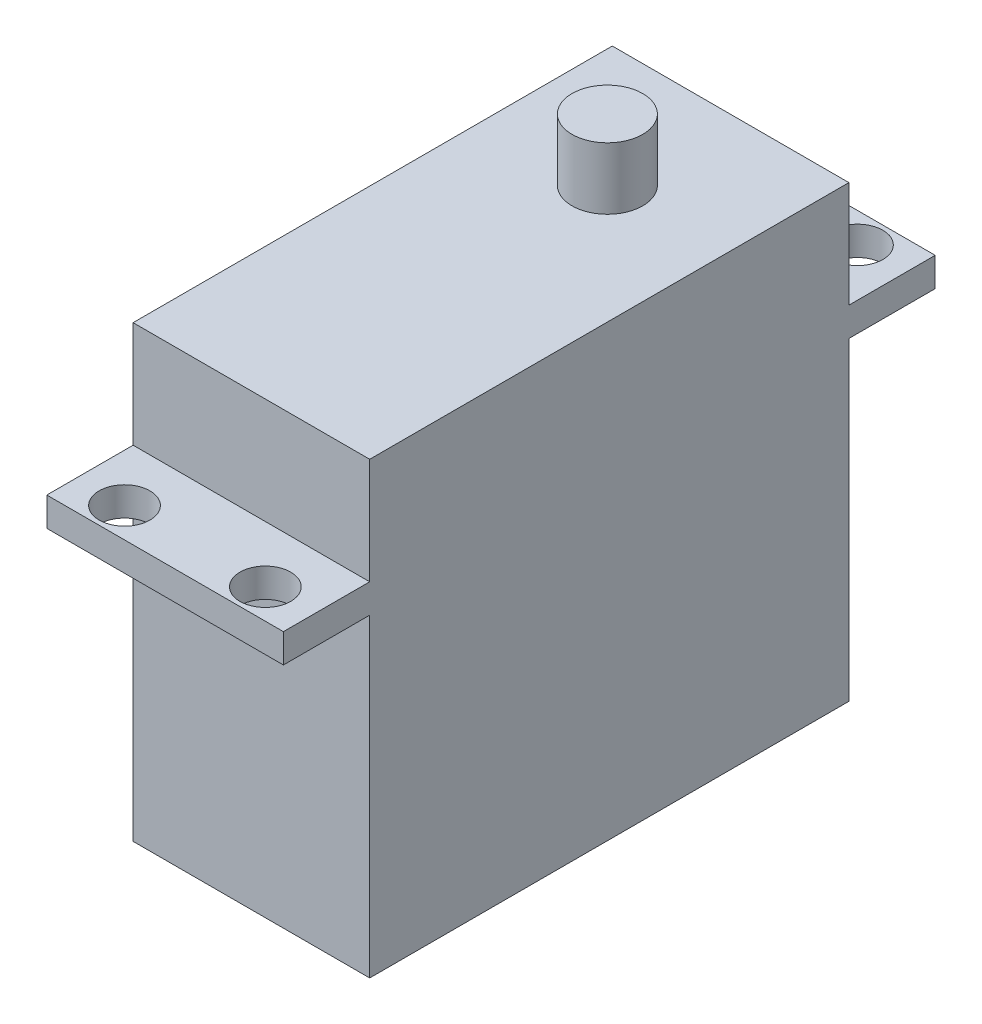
from build123d import *

# Parameters (mm, degrees)
SKETCH1_W                    = 20.066
SKETCH1_H                    = 40.64
EXTRUDE1_DEPTH               = 38.1
SKETCH3_W                    = 20.066
SKETCH3_H                    = 2.45
EXTRUDE3_DEPTH               = 7.32
SKETCH4_R                    = 3
EXTRUDE4_DEPTH               = 5.25
F_18_0_1695_DIAMETER_HOLE1_D = 4.3053
MIRROR3_COPY_1_D             = 4.3053


with BuildPart() as part:
    # Sketch1 → Extrude1 (new body)
    with BuildSketch(Plane(origin=(0, 0, 0), x_dir=(1, 0, 0), z_dir=(0, 1, 0))):
        Rectangle(SKETCH1_W, SKETCH1_H)
    extrude(amount=EXTRUDE1_DEPTH)

    # Sketch3 → Extrude3 (add)
    with BuildSketch(Plane.XY.offset(20.32)):
        with Locations((0, 27.875)):
            Rectangle(SKETCH3_W, SKETCH3_H)
    extrude3 = extrude(amount=EXTRUDE3_DEPTH)

    # Mirror1: Extrude3 across plane
    add(extrude3.mirror(Plane.XY))

    # Sketch4 → Extrude4 (add)
    with BuildSketch(Plane(origin=(0, 38.1, 0), x_dir=(1, 0, 0), z_dir=(0, 1, 0))):
        with Locations(Location((0, 9.87, 0), (0, 0, 90))):
            Circle(SKETCH4_R)
    extrude(amount=EXTRUDE4_DEPTH)

    # 18 _0.1695_ Diameter Hole1 (through all)
    with Locations(Plane(origin=(5.970587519, 29.1, 25.11), x_dir=(0, 0, 1), z_dir=(0, 1, 0))):
        with Locations((0, 0)):
            f_18_0_1695_diameter_hole1 = Hole(F_18_0_1695_DIAMETER_HOLE1_D / 2)

    # Mirror2: 18 _0.1695_ Diameter Hole1 across plane
    add(f_18_0_1695_diameter_hole1.mirror(Plane.XY), mode=Mode.SUBTRACT)

    # Mirror3: 18 _0.1695_ Diameter Hole1 across plane
    add(f_18_0_1695_diameter_hole1.mirror(Plane(origin=(0, 0, 0), x_dir=(0, 0, 1), z_dir=(1, 0, 0))), mode=Mode.SUBTRACT)

    # Mirror3 copy 1 (through all)
    with Locations(Plane(origin=(-5.970587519, 29.1, -25.11), x_dir=(0, 0, -1), z_dir=(0, 1, 0))):
        with Locations((0, 0)):
            Hole(MIRROR3_COPY_1_D / 2)


solid = part.part
